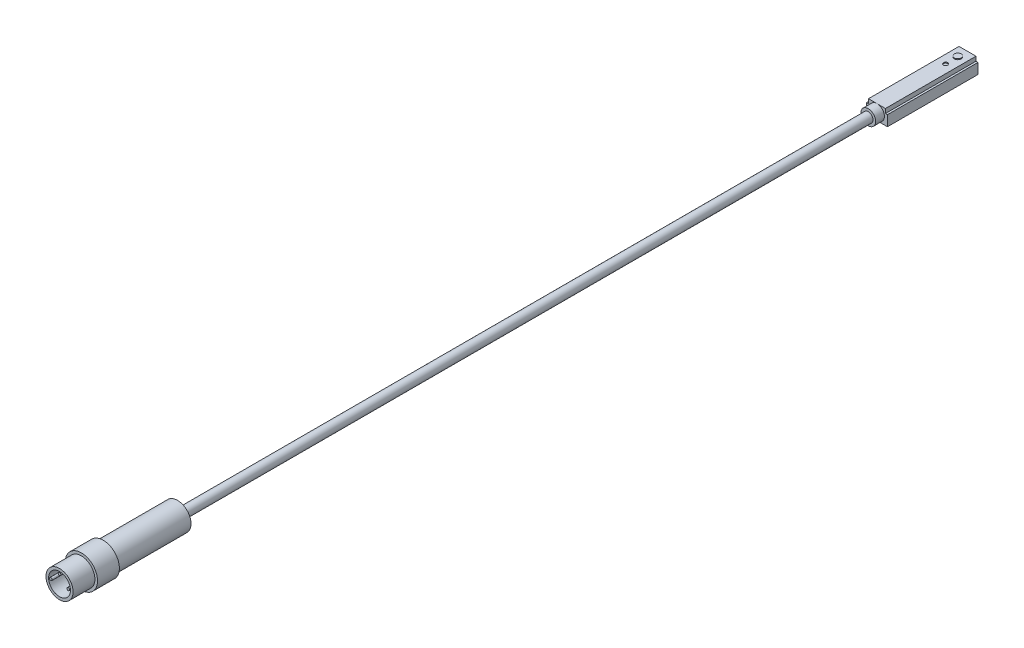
from build123d import *

# Parameters (mm, degrees)
EXTRUDE1_DEPTH     = 28.8544
SKETCH2_OUTSIDE_W  = 14.058
SKETCH2_OUTSIDE_H  = 12.28
SKETCH2_OUTSIDE_R  = 2.159
CUT_EXTRUDE1_DEPTH = 2.54
SKETCH3_W          = 5.08
SKETCH3_H          = 1.016
SKETCH4_R          = 1.397
EXTRUDE2_DEPTH     = 263.906
SKETCH6_R          = 3.175
SKETCH6_R_2        = 0.381
CUT_EXTRUDE2_DEPTH = 5.08
SKETCH7_R          = 0.635
CUT_EXTRUDE3_DEPTH = 0.254


with BuildPart() as part:
    # S2D0001 → Extrude1 (new body)
    with BuildSketch(Plane.XY):
        Polygon((-3.048, 0), (-3.048, 3.048), (-2.4638, 3.048), (-2.4638, 4.318), (2.4638, 4.318), (2.4638, 3.048), (3.048, 3.048), (3.048, 0), align=None)
    extrude(amount=EXTRUDE1_DEPTH)

    # Sketch2 outside → Cut-Extrude1 (cut)
    with BuildSketch(Plane.XY.offset(28.8544)):
        with Locations((0, 2.159)):
            Rectangle(SKETCH2_OUTSIDE_W, SKETCH2_OUTSIDE_H)
        with Locations(Location((0, 2.159, 0), (0, 0, 270))):
            Circle(SKETCH2_OUTSIDE_R, mode=Mode.SUBTRACT)
    extrude(amount=-CUT_EXTRUDE1_DEPTH, mode=Mode.SUBTRACT)

    # Sketch3 → Revolve1 (revolve)
    with BuildSketch(Plane.YZ, mode=Mode.PRIVATE) as revolve1_sk:
        with Locations((2.032, 3.330404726)):
            Rectangle(SKETCH3_W, SKETCH3_H)
    revolve(revolve1_sk.sketch.rotate(Axis((0, -0.762, 2.822404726), (0, 1, 0)), 180), axis=Axis((0, -0.762, 2.822404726), (0, 1, 0)))

    # Sketch4 → Extrude2 (add)
    with BuildSketch(Plane(origin=(0, 0, 0), x_dir=(-1, 0, 0), z_dir=(0, 0, -1))):
        with Locations((0, 2.159)):
            Circle(SKETCH4_R)
    extrude(amount=-EXTRUDE2_DEPTH)

    # Sketch5 → Revolve2 (revolve)
    with BuildSketch(Plane(origin=(0, 0, 0), x_dir=(0, 0, -1), z_dir=(1, 0, 0)), mode=Mode.PRIVATE) as revolve2_sk:
        Polygon((-263.906, 2.159), (-263.906, 6.096), (-257.556, 6.096), (-257.556, 6.858), (-251.206, 6.858), (-251.206, 6.096), (-229.616, 6.096), (-229.616, 2.159), align=None)
    revolve(revolve2_sk.sketch.rotate(Axis((0, 2.159, 265.6205), (0, 0, -1)), 90), axis=Axis((0, 2.159, 265.6205), (0, 0, -1)))

    # Sketch6 → Cut-Extrude2 (cut)
    with BuildSketch(Plane.XY.offset(263.906)):
        with Locations((0, 2.159)):
            Circle(SKETCH6_R)
        with Locations((0, 4.699)):
            Circle(SKETCH6_R_2, mode=Mode.SUBTRACT)
        with Locations((2.54, 2.159)):
            Circle(SKETCH6_R_2, mode=Mode.SUBTRACT)
        with Locations((-2.54, 2.159)):
            Circle(SKETCH6_R_2, mode=Mode.SUBTRACT)
    extrude(amount=-CUT_EXTRUDE2_DEPTH, mode=Mode.SUBTRACT)

    # Sketch7 → Cut-Extrude3 (cut)
    with BuildSketch(Plane(origin=(0, 4.318, 0), x_dir=(1, 0, 0), z_dir=(0, 1, 0))):
        with Locations(Location((0, -6.35, 0), (0, 0, 270))):
            Circle(SKETCH7_R)
    extrude(amount=-CUT_EXTRUDE3_DEPTH, mode=Mode.SUBTRACT)


solid = part.part
